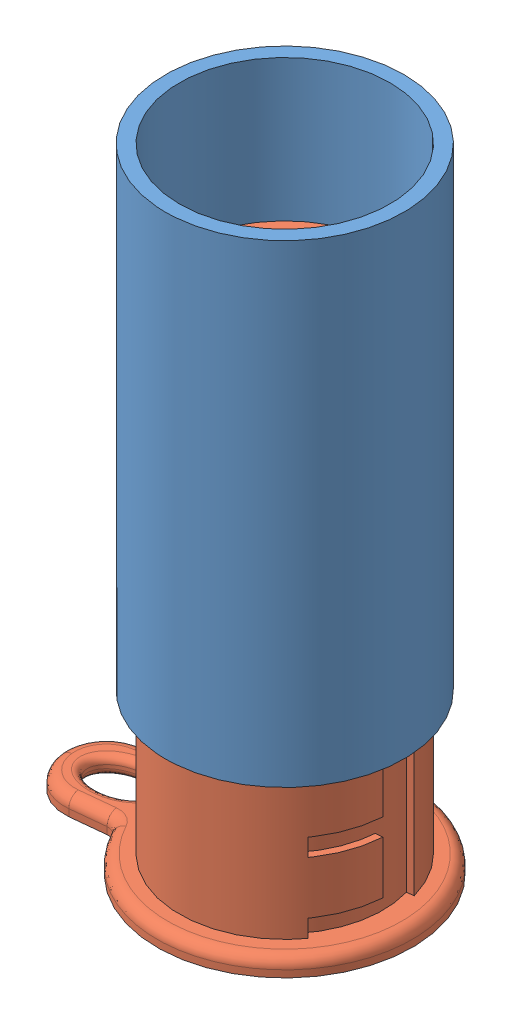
SolidWorks assembly Assem1.sldasm, configuration Default (file format 13000). Lengths in mm.
Overall size (129.18 229.03 104.29).
2 component instances, 2 part files, 2 mates.
Components (placement in the parent):
- outside cylinder m2-1: outside cylinder m2.SLDPRT [Default] at (91.2285 -6.4613 124.1686) size (86.36 171.45 86.36)
- inside cylinder m2-1: inside cylinder m2.SLDPRT [Default] at (91.2285 -64.0382 124.1686) x (0.102608 0 0.994722) z (-0.994722 0 0.102608) size (92.43 177.8 120.33)
Mates (geometry in assembly coordinates):
- Concentric4: concentric anti-aligned: cylinder of outside cylinder m2-1 through (91.2285 -6.4613 124.1686) axis (0 1 0) radius 38.1; cylinder of inside cylinder m2-1 through (91.2285 113.7618 124.1686) axis (0 -1 0) radius 38.1
- Tangent2: tangent anti-aligned: plane of outside cylinder m2-1 through (126.7885 -6.4613 124.1686) normal (-1 0 0); cylinder of inside cylinder m2-1 through (91.2285 113.7618 124.1686) axis (0 -1 0) radius 35.56
